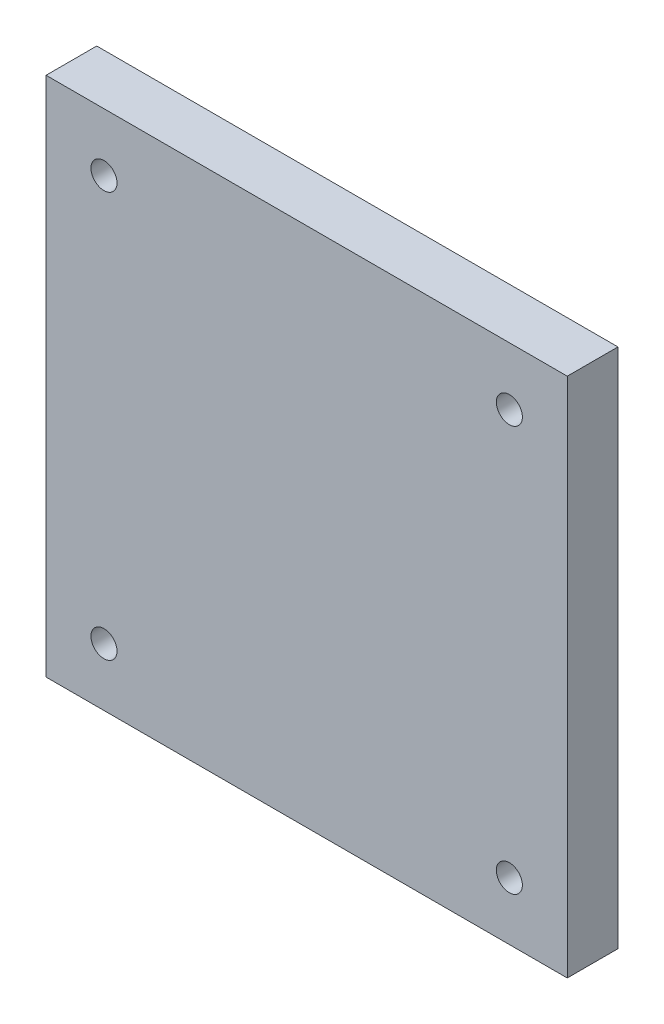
ISO-10303-21;
HEADER;
FILE_DESCRIPTION(('STEP AP214'),'2;1');
FILE_NAME('part.step','',(''),(''),'','','');
FILE_SCHEMA(('AUTOMOTIVE_DESIGN { 1 0 10303 214 1 1 1 1 }'));
ENDSEC;
DATA;
#1=APPLICATION_CONTEXT('core data for automotive mechanical design processes');
#2=APPLICATION_PROTOCOL_DEFINITION('international standard','automotive_design',2000,#1);
#3=PRODUCT_CONTEXT('',#1,'mechanical');
#4=PRODUCT('Part','Part','',(#3));
#5=PRODUCT_RELATED_PRODUCT_CATEGORY('part','',(#4));
#6=PRODUCT_DEFINITION_FORMATION('','',#4);
#7=PRODUCT_DEFINITION_CONTEXT('part definition',#1,'design');
#8=PRODUCT_DEFINITION('design','',#6,#7);
#9=PRODUCT_DEFINITION_SHAPE('','',#8);
#10=(LENGTH_UNIT() NAMED_UNIT(*) SI_UNIT(.MILLI.,.METRE.));
#11=(NAMED_UNIT(*) PLANE_ANGLE_UNIT() SI_UNIT($,.RADIAN.));
#12=(NAMED_UNIT(*) SI_UNIT($,.STERADIAN.) SOLID_ANGLE_UNIT());
#13=UNCERTAINTY_MEASURE_WITH_UNIT(LENGTH_MEASURE(1.E-05),#10,'distance_accuracy_value','');
#14=(GEOMETRIC_REPRESENTATION_CONTEXT(3) GLOBAL_UNCERTAINTY_ASSIGNED_CONTEXT((#13)) GLOBAL_UNIT_ASSIGNED_CONTEXT((#10,
#11,#12)) REPRESENTATION_CONTEXT('',''));
#15=CARTESIAN_POINT('',(0.,0.,0.));
#16=DIRECTION('',(0.,0.,1.));
#17=DIRECTION('',(1.,0.,0.));
#18=AXIS2_PLACEMENT_3D('',#15,#16,#17);
#19=CARTESIAN_POINT('',(0.,0.,35.));
#20=DIRECTION('',(0.,0.,1.));
#21=DIRECTION('',(1.,0.,0.));
#22=AXIS2_PLACEMENT_3D('',#19,#20,#21);
#23=PLANE('',#22);
#24=CARTESIAN_POINT('',(140.,140.,35.));
#25=DIRECTION('',(0.,0.,1.));
#26=DIRECTION('',(1.,0.,0.));
#27=AXIS2_PLACEMENT_3D('',#24,#25,#26);
#28=CIRCLE('',#27,9.);
#29=CARTESIAN_POINT('',(149.,140.,35.));
#30=VERTEX_POINT('',#29);
#31=EDGE_CURVE('E24',#30,#30,#28,.T.);
#32=ORIENTED_EDGE('',*,*,#31,.F.);
#33=EDGE_LOOP('',(#32));
#34=FACE_BOUND('',#33,.T.);
#35=CARTESIAN_POINT('',(140.,-140.,35.));
#36=DIRECTION('',(0.,0.,1.));
#37=DIRECTION('',(1.,0.,0.));
#38=AXIS2_PLACEMENT_3D('',#35,#36,#37);
#39=CIRCLE('',#38,9.);
#40=CARTESIAN_POINT('',(149.,-140.,35.));
#41=VERTEX_POINT('',#40);
#42=EDGE_CURVE('E180',#41,#41,#39,.T.);
#43=ORIENTED_EDGE('',*,*,#42,.F.);
#44=EDGE_LOOP('',(#43));
#45=FACE_BOUND('',#44,.T.);
#46=CARTESIAN_POINT('',(-140.,140.,35.));
#47=DIRECTION('',(0.,0.,1.));
#48=DIRECTION('',(1.,0.,0.));
#49=AXIS2_PLACEMENT_3D('',#46,#47,#48);
#50=CIRCLE('',#49,9.);
#51=CARTESIAN_POINT('',(-131.,140.,35.));
#52=VERTEX_POINT('',#51);
#53=EDGE_CURVE('E168',#52,#52,#50,.T.);
#54=ORIENTED_EDGE('',*,*,#53,.F.);
#55=EDGE_LOOP('',(#54));
#56=FACE_BOUND('',#55,.T.);
#57=CARTESIAN_POINT('',(-140.,-140.,35.));
#58=DIRECTION('',(0.,0.,1.));
#59=DIRECTION('',(1.,0.,0.));
#60=AXIS2_PLACEMENT_3D('',#57,#58,#59);
#61=CIRCLE('',#60,9.);
#62=CARTESIAN_POINT('',(-131.,-140.,35.));
#63=VERTEX_POINT('',#62);
#64=EDGE_CURVE('E158',#63,#63,#61,.T.);
#65=ORIENTED_EDGE('',*,*,#64,.F.);
#66=EDGE_LOOP('',(#65));
#67=FACE_BOUND('',#66,.T.);
#68=DIRECTION('',(1.,0.,0.));
#69=VECTOR('',#68,1.);
#70=CARTESIAN_POINT('',(-180.,-180.,35.));
#71=LINE('',#70,#69);
#72=CARTESIAN_POINT('',(-180.,-180.,35.));
#73=VERTEX_POINT('',#72);
#74=CARTESIAN_POINT('',(180.,-180.,35.));
#75=VERTEX_POINT('',#74);
#76=EDGE_CURVE('E120',#73,#75,#71,.T.);
#77=ORIENTED_EDGE('',*,*,#76,.T.);
#78=DIRECTION('',(0.,1.,0.));
#79=VECTOR('',#78,1.);
#80=CARTESIAN_POINT('',(180.,-180.,35.));
#81=LINE('',#80,#79);
#82=CARTESIAN_POINT('',(180.,180.,35.));
#83=VERTEX_POINT('',#82);
#84=EDGE_CURVE('E136',#75,#83,#81,.T.);
#85=ORIENTED_EDGE('',*,*,#84,.T.);
#86=DIRECTION('',(-1.,0.,0.));
#87=VECTOR('',#86,1.);
#88=CARTESIAN_POINT('',(180.,180.,35.));
#89=LINE('',#88,#87);
#90=CARTESIAN_POINT('',(-180.,180.,35.));
#91=VERTEX_POINT('',#90);
#92=EDGE_CURVE('E112',#83,#91,#89,.T.);
#93=ORIENTED_EDGE('',*,*,#92,.T.);
#94=DIRECTION('',(0.,-1.,0.));
#95=VECTOR('',#94,1.);
#96=CARTESIAN_POINT('',(-180.,180.,35.));
#97=LINE('',#96,#95);
#98=EDGE_CURVE('E111',#91,#73,#97,.T.);
#99=ORIENTED_EDGE('',*,*,#98,.T.);
#100=EDGE_LOOP('',(#77,#85,#93,#99));
#101=FACE_BOUND('',#100,.T.);
#102=ADVANCED_FACE('F16',(#34,#45,#56,#67,#101),#23,.T.);
#103=CARTESIAN_POINT('',(0.,0.,0.));
#104=DIRECTION('',(0.,0.,1.));
#105=DIRECTION('',(1.,0.,0.));
#106=AXIS2_PLACEMENT_3D('',#103,#104,#105);
#107=PLANE('',#106);
#108=CARTESIAN_POINT('',(140.,140.,0.));
#109=DIRECTION('',(0.,0.,1.));
#110=DIRECTION('',(1.,0.,0.));
#111=AXIS2_PLACEMENT_3D('',#108,#109,#110);
#112=CIRCLE('',#111,9.);
#113=CARTESIAN_POINT('',(149.,140.,0.));
#114=VERTEX_POINT('',#113);
#115=EDGE_CURVE('E10',#114,#114,#112,.T.);
#116=ORIENTED_EDGE('',*,*,#115,.T.);
#117=EDGE_LOOP('',(#116));
#118=FACE_BOUND('',#117,.T.);
#119=CARTESIAN_POINT('',(140.,-140.,0.));
#120=DIRECTION('',(0.,0.,1.));
#121=DIRECTION('',(1.,0.,0.));
#122=AXIS2_PLACEMENT_3D('',#119,#120,#121);
#123=CIRCLE('',#122,9.);
#124=CARTESIAN_POINT('',(149.,-140.,0.));
#125=VERTEX_POINT('',#124);
#126=EDGE_CURVE('E183',#125,#125,#123,.T.);
#127=ORIENTED_EDGE('',*,*,#126,.T.);
#128=EDGE_LOOP('',(#127));
#129=FACE_BOUND('',#128,.T.);
#130=CARTESIAN_POINT('',(-140.,140.,0.));
#131=DIRECTION('',(0.,0.,1.));
#132=DIRECTION('',(1.,0.,0.));
#133=AXIS2_PLACEMENT_3D('',#130,#131,#132);
#134=CIRCLE('',#133,9.);
#135=CARTESIAN_POINT('',(-131.,140.,0.));
#136=VERTEX_POINT('',#135);
#137=EDGE_CURVE('E173',#136,#136,#134,.T.);
#138=ORIENTED_EDGE('',*,*,#137,.T.);
#139=EDGE_LOOP('',(#138));
#140=FACE_BOUND('',#139,.T.);
#141=CARTESIAN_POINT('',(-140.,-140.,0.));
#142=DIRECTION('',(0.,0.,1.));
#143=DIRECTION('',(1.,0.,0.));
#144=AXIS2_PLACEMENT_3D('',#141,#142,#143);
#145=CIRCLE('',#144,9.);
#146=CARTESIAN_POINT('',(-131.,-140.,0.));
#147=VERTEX_POINT('',#146);
#148=EDGE_CURVE('E163',#147,#147,#145,.T.);
#149=ORIENTED_EDGE('',*,*,#148,.T.);
#150=EDGE_LOOP('',(#149));
#151=FACE_BOUND('',#150,.T.);
#152=DIRECTION('',(0.,-1.,0.));
#153=VECTOR('',#152,1.);
#154=CARTESIAN_POINT('',(-180.,180.,0.));
#155=LINE('',#154,#153);
#156=CARTESIAN_POINT('',(-180.,180.,0.));
#157=VERTEX_POINT('',#156);
#158=CARTESIAN_POINT('',(-180.,-180.,0.));
#159=VERTEX_POINT('',#158);
#160=EDGE_CURVE('E100',#157,#159,#155,.T.);
#161=ORIENTED_EDGE('',*,*,#160,.F.);
#162=DIRECTION('',(-1.,0.,0.));
#163=VECTOR('',#162,1.);
#164=CARTESIAN_POINT('',(180.,180.,0.));
#165=LINE('',#164,#163);
#166=CARTESIAN_POINT('',(180.,180.,0.));
#167=VERTEX_POINT('',#166);
#168=EDGE_CURVE('E140',#167,#157,#165,.T.);
#169=ORIENTED_EDGE('',*,*,#168,.F.);
#170=DIRECTION('',(0.,1.,0.));
#171=VECTOR('',#170,1.);
#172=CARTESIAN_POINT('',(180.,-180.,0.));
#173=LINE('',#172,#171);
#174=CARTESIAN_POINT('',(180.,-180.,0.));
#175=VERTEX_POINT('',#174);
#176=EDGE_CURVE('E122',#175,#167,#173,.T.);
#177=ORIENTED_EDGE('',*,*,#176,.F.);
#178=DIRECTION('',(1.,0.,0.));
#179=VECTOR('',#178,1.);
#180=CARTESIAN_POINT('',(-180.,-180.,0.));
#181=LINE('',#180,#179);
#182=EDGE_CURVE('E118',#159,#175,#181,.T.);
#183=ORIENTED_EDGE('',*,*,#182,.F.);
#184=EDGE_LOOP('',(#161,#169,#177,#183));
#185=FACE_BOUND('',#184,.T.);
#186=ADVANCED_FACE('F124',(#118,#129,#140,#151,#185),#107,.F.);
#187=CARTESIAN_POINT('',(140.,140.,0.));
#188=DIRECTION('',(0.,0.,-1.));
#189=DIRECTION('',(1.,0.,0.));
#190=AXIS2_PLACEMENT_3D('',#187,#188,#189);
#191=CYLINDRICAL_SURFACE('',#190,9.);
#192=DIRECTION('',(0.,0.,1.));
#193=VECTOR('',#192,1.);
#194=CARTESIAN_POINT('',(149.,140.,0.));
#195=LINE('',#194,#193);
#196=EDGE_CURVE('E186',#114,#30,#195,.T.);
#197=ORIENTED_EDGE('',*,*,#196,.T.);
#198=ORIENTED_EDGE('',*,*,#31,.T.);
#199=ORIENTED_EDGE('',*,*,#196,.F.);
#200=ORIENTED_EDGE('',*,*,#115,.F.);
#201=EDGE_LOOP('',(#197,#198,#199,#200));
#202=FACE_BOUND('',#201,.T.);
#203=ADVANCED_FACE('F211',(#202),#191,.F.);
#204=CARTESIAN_POINT('',(140.,-140.,0.));
#205=DIRECTION('',(0.,0.,-1.));
#206=DIRECTION('',(1.,0.,0.));
#207=AXIS2_PLACEMENT_3D('',#204,#205,#206);
#208=CYLINDRICAL_SURFACE('',#207,9.);
#209=DIRECTION('',(0.,0.,1.));
#210=VECTOR('',#209,1.);
#211=CARTESIAN_POINT('',(149.,-140.,0.));
#212=LINE('',#211,#210);
#213=EDGE_CURVE('E176',#125,#41,#212,.T.);
#214=ORIENTED_EDGE('',*,*,#213,.T.);
#215=ORIENTED_EDGE('',*,*,#42,.T.);
#216=ORIENTED_EDGE('',*,*,#213,.F.);
#217=ORIENTED_EDGE('',*,*,#126,.F.);
#218=EDGE_LOOP('',(#214,#215,#216,#217));
#219=FACE_BOUND('',#218,.T.);
#220=ADVANCED_FACE('F205',(#219),#208,.F.);
#221=CARTESIAN_POINT('',(-140.,140.,0.));
#222=DIRECTION('',(0.,0.,-1.));
#223=DIRECTION('',(1.,0.,0.));
#224=AXIS2_PLACEMENT_3D('',#221,#222,#223);
#225=CYLINDRICAL_SURFACE('',#224,9.);
#226=DIRECTION('',(0.,0.,1.));
#227=VECTOR('',#226,1.);
#228=CARTESIAN_POINT('',(-131.,140.,0.));
#229=LINE('',#228,#227);
#230=EDGE_CURVE('E164',#136,#52,#229,.T.);
#231=ORIENTED_EDGE('',*,*,#230,.T.);
#232=ORIENTED_EDGE('',*,*,#53,.T.);
#233=ORIENTED_EDGE('',*,*,#230,.F.);
#234=ORIENTED_EDGE('',*,*,#137,.F.);
#235=EDGE_LOOP('',(#231,#232,#233,#234));
#236=FACE_BOUND('',#235,.T.);
#237=ADVANCED_FACE('F210',(#236),#225,.F.);
#238=CARTESIAN_POINT('',(-140.,-140.,0.));
#239=DIRECTION('',(0.,0.,-1.));
#240=DIRECTION('',(1.,0.,0.));
#241=AXIS2_PLACEMENT_3D('',#238,#239,#240);
#242=CYLINDRICAL_SURFACE('',#241,9.);
#243=DIRECTION('',(0.,0.,1.));
#244=VECTOR('',#243,1.);
#245=CARTESIAN_POINT('',(-131.,-140.,0.));
#246=LINE('',#245,#244);
#247=EDGE_CURVE('E147',#147,#63,#246,.T.);
#248=ORIENTED_EDGE('',*,*,#247,.T.);
#249=ORIENTED_EDGE('',*,*,#64,.T.);
#250=ORIENTED_EDGE('',*,*,#247,.F.);
#251=ORIENTED_EDGE('',*,*,#148,.F.);
#252=EDGE_LOOP('',(#248,#249,#250,#251));
#253=FACE_BOUND('',#252,.T.);
#254=ADVANCED_FACE('F231',(#253),#242,.F.);
#255=CARTESIAN_POINT('',(-180.,180.,0.));
#256=DIRECTION('',(1.,0.,0.));
#257=DIRECTION('',(0.,1.,0.));
#258=AXIS2_PLACEMENT_3D('',#255,#256,#257);
#259=PLANE('',#258);
#260=ORIENTED_EDGE('',*,*,#160,.T.);
#261=DIRECTION('',(0.,0.,1.));
#262=VECTOR('',#261,1.);
#263=CARTESIAN_POINT('',(-180.,-180.,0.));
#264=LINE('',#263,#262);
#265=EDGE_CURVE('E103',#159,#73,#264,.T.);
#266=ORIENTED_EDGE('',*,*,#265,.T.);
#267=ORIENTED_EDGE('',*,*,#98,.F.);
#268=DIRECTION('',(0.,0.,1.));
#269=VECTOR('',#268,1.);
#270=CARTESIAN_POINT('',(-180.,180.,0.));
#271=LINE('',#270,#269);
#272=EDGE_CURVE('E106',#157,#91,#271,.T.);
#273=ORIENTED_EDGE('',*,*,#272,.F.);
#274=EDGE_LOOP('',(#260,#266,#267,#273));
#275=FACE_BOUND('',#274,.T.);
#276=ADVANCED_FACE('F102',(#275),#259,.F.);
#277=CARTESIAN_POINT('',(180.,180.,0.));
#278=DIRECTION('',(0.,-1.,0.));
#279=DIRECTION('',(0.,0.,-1.));
#280=AXIS2_PLACEMENT_3D('',#277,#278,#279);
#281=PLANE('',#280);
#282=ORIENTED_EDGE('',*,*,#168,.T.);
#283=ORIENTED_EDGE('',*,*,#272,.T.);
#284=ORIENTED_EDGE('',*,*,#92,.F.);
#285=DIRECTION('',(0.,0.,1.));
#286=VECTOR('',#285,1.);
#287=CARTESIAN_POINT('',(180.,180.,0.));
#288=LINE('',#287,#286);
#289=EDGE_CURVE('E141',#167,#83,#288,.T.);
#290=ORIENTED_EDGE('',*,*,#289,.F.);
#291=EDGE_LOOP('',(#282,#283,#284,#290));
#292=FACE_BOUND('',#291,.T.);
#293=ADVANCED_FACE('F221',(#292),#281,.F.);
#294=CARTESIAN_POINT('',(180.,-180.,0.));
#295=DIRECTION('',(-1.,0.,0.));
#296=DIRECTION('',(0.,0.,1.));
#297=AXIS2_PLACEMENT_3D('',#294,#295,#296);
#298=PLANE('',#297);
#299=ORIENTED_EDGE('',*,*,#176,.T.);
#300=ORIENTED_EDGE('',*,*,#289,.T.);
#301=ORIENTED_EDGE('',*,*,#84,.F.);
#302=DIRECTION('',(0.,0.,1.));
#303=VECTOR('',#302,1.);
#304=CARTESIAN_POINT('',(180.,-180.,0.));
#305=LINE('',#304,#303);
#306=EDGE_CURVE('E128',#175,#75,#305,.T.);
#307=ORIENTED_EDGE('',*,*,#306,.F.);
#308=EDGE_LOOP('',(#299,#300,#301,#307));
#309=FACE_BOUND('',#308,.T.);
#310=ADVANCED_FACE('F199',(#309),#298,.F.);
#311=CARTESIAN_POINT('',(-180.,-180.,0.));
#312=DIRECTION('',(0.,1.,0.));
#313=DIRECTION('',(1.,0.,0.));
#314=AXIS2_PLACEMENT_3D('',#311,#312,#313);
#315=PLANE('',#314);
#316=ORIENTED_EDGE('',*,*,#182,.T.);
#317=ORIENTED_EDGE('',*,*,#306,.T.);
#318=ORIENTED_EDGE('',*,*,#76,.F.);
#319=ORIENTED_EDGE('',*,*,#265,.F.);
#320=EDGE_LOOP('',(#316,#317,#318,#319));
#321=FACE_BOUND('',#320,.T.);
#322=ADVANCED_FACE('F116',(#321),#315,.F.);
#323=CLOSED_SHELL('',(#102,#186,#203,#220,#237,#254,#276,#293,#310,#322));
#324=MANIFOLD_SOLID_BREP('B1',#323);
#325=ADVANCED_BREP_SHAPE_REPRESENTATION('',(#18,#324),#14);
#326=SHAPE_DEFINITION_REPRESENTATION(#9,#325);
ENDSEC;
END-ISO-10303-21;
